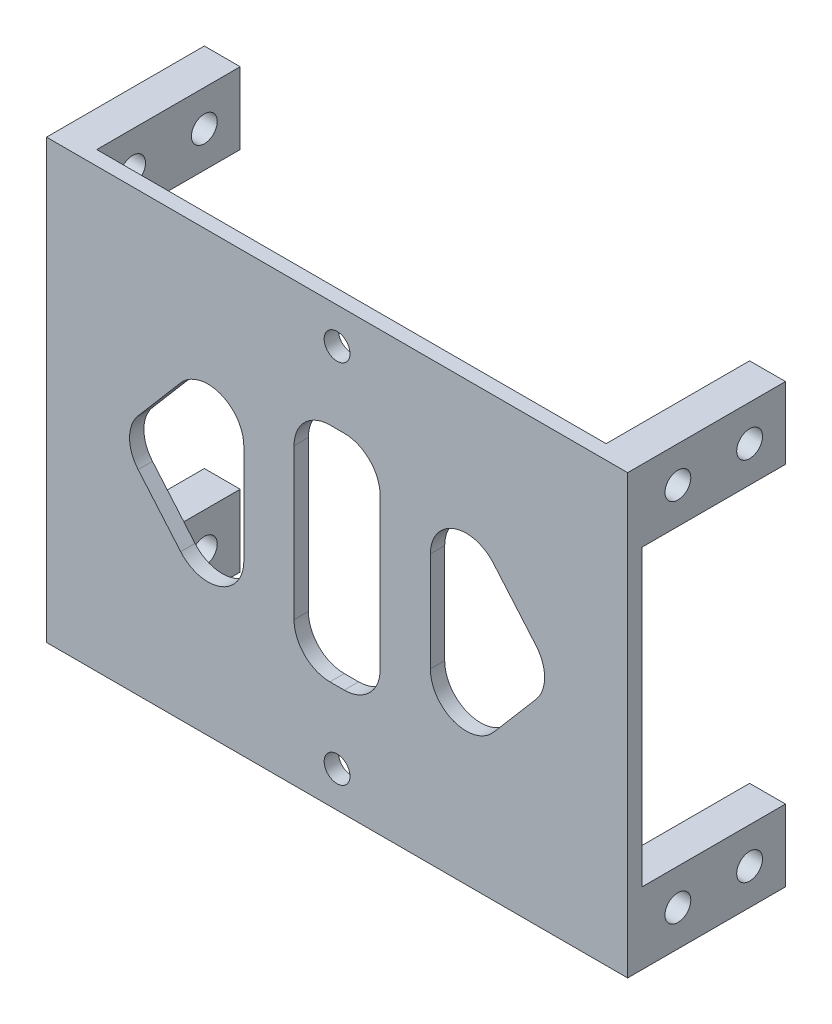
from build123d import *

# Parameters (mm, degrees)
ESQUISSE1_W             = 81
ESQUISSE1_H             = 61
ESQUISSE1_R             = 1.8
ESQUISSE1_W_2           = 12
ESQUISSE1_H_2           = 31
BOSS_EXTRU_1_DEPTH      = 2
ESQUISSE2_W             = 5
ESQUISSE2_H             = 10
BOSS_EXTRU_2_DEPTH      = 20
ESQUISSE3_R             = 1.8
ENL_V_MAT_EXTRU_1_DEPTH = 104.353761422
CONG_2_R                = 5


with BuildPart() as part:
    # Esquisse1 → Boss.-Extru.1 (new body)
    with BuildSketch(Plane.XY):
        with Locations((40.5, 30.5)):
            Rectangle(ESQUISSE1_W, ESQUISSE1_H)
        with Locations((40.5, 56)):
            Circle(ESQUISSE1_R, mode=Mode.SUBTRACT)
        with Locations((40.5, 5)):
            Circle(ESQUISSE1_R, mode=Mode.SUBTRACT)
        Polygon((10, 30.5), (27.5, 51), (27.5, 10), align=None, mode=Mode.SUBTRACT)
        Polygon((53.5, 51), (53.5, 10), (71, 30.5), align=None, mode=Mode.SUBTRACT)
        with Locations((40.5, 30.5)):
            Rectangle(ESQUISSE1_W_2, ESQUISSE1_H_2, mode=Mode.SUBTRACT)
    extrude(amount=BOSS_EXTRU_1_DEPTH)

    # Esquisse2 → Boss.-Extru.2 (add)
    with BuildSketch(Plane(origin=(0, 0, 0), x_dir=(-1, 0, 0), z_dir=(0, 0, -1))):
        with Locations((-78.5, 56)):
            Rectangle(ESQUISSE2_W, ESQUISSE2_H)
        with Locations((-78.5, 5)):
            Rectangle(ESQUISSE2_W, ESQUISSE2_H)
        with Locations((-2.5, 56)):
            Rectangle(ESQUISSE2_W, ESQUISSE2_H)
        with Locations((-2.5, 5)):
            Rectangle(ESQUISSE2_W, ESQUISSE2_H)
    extrude(amount=BOSS_EXTRU_2_DEPTH)

    # Esquisse3 → Enl_v. mat.-Extru.1 (cut, through all)
    with BuildSketch(Plane.ZY):
        with Locations(Location((-15, 56, 0), (0, 0, 270))):
            Circle(ESQUISSE3_R)
        with Locations(Location((-5, 56, 0), (0, 0, 270))):
            Circle(ESQUISSE3_R)
        with Locations(Location((-15, 5, 0), (0, 0, 270))):
            Circle(ESQUISSE3_R)
        with Locations(Location((-5, 5, 0), (0, 0, 270))):
            Circle(ESQUISSE3_R)
    extrude(amount=-ENL_V_MAT_EXTRU_1_DEPTH, mode=Mode.SUBTRACT)

    # Cong_2
    cong_2_edges = [part.edges().sort_by_distance(p)[0] for p in [
        (10, 30.5, 1),
        (27.5, 10, 1),
        (27.5, 51, 1),
        (71, 30.5, 1),
        (53.5, 51, 1),
        (53.5, 10, 1),
        (34.5, 46, 1),
        (34.5, 15, 1),
        (46.5, 15, 1),
        (46.5, 46, 1),
    ]]
    fillet(cong_2_edges, radius=CONG_2_R)


solid = part.part
